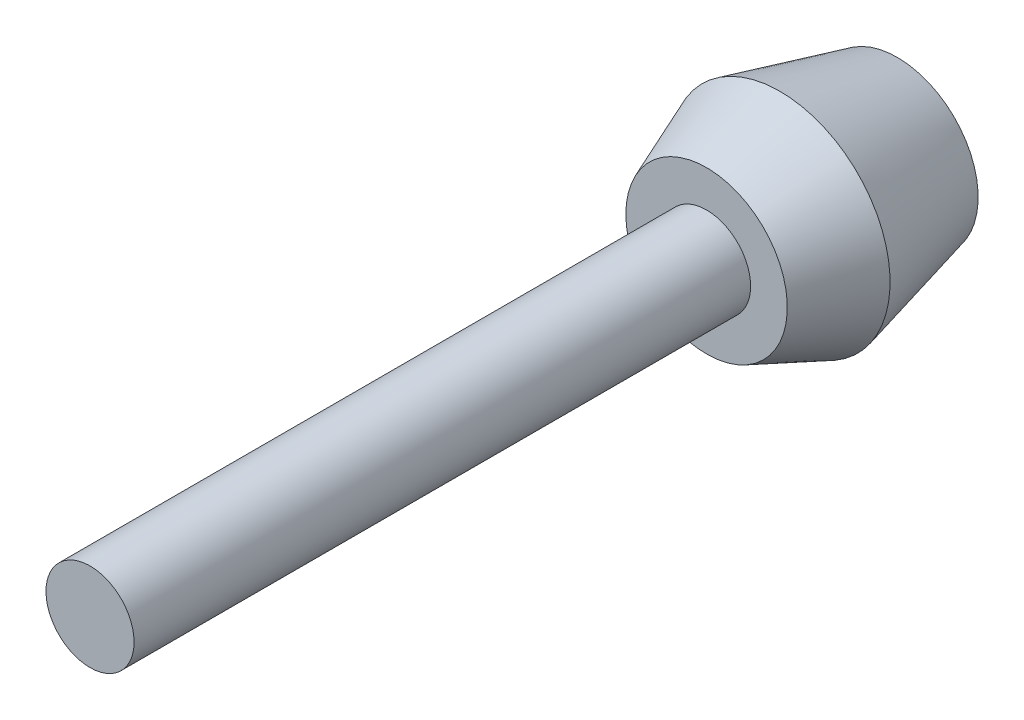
ISO-10303-21;
HEADER;
FILE_DESCRIPTION(('STEP AP214'),'2;1');
FILE_NAME('part.step','',(''),(''),'','','');
FILE_SCHEMA(('AUTOMOTIVE_DESIGN { 1 0 10303 214 1 1 1 1 }'));
ENDSEC;
DATA;
#1=APPLICATION_CONTEXT('core data for automotive mechanical design processes');
#2=APPLICATION_PROTOCOL_DEFINITION('international standard','automotive_design',2000,#1);
#3=PRODUCT_CONTEXT('',#1,'mechanical');
#4=PRODUCT('Part','Part','',(#3));
#5=PRODUCT_RELATED_PRODUCT_CATEGORY('part','',(#4));
#6=PRODUCT_DEFINITION_FORMATION('','',#4);
#7=PRODUCT_DEFINITION_CONTEXT('part definition',#1,'design');
#8=PRODUCT_DEFINITION('design','',#6,#7);
#9=PRODUCT_DEFINITION_SHAPE('','',#8);
#10=(LENGTH_UNIT() NAMED_UNIT(*) SI_UNIT(.MILLI.,.METRE.));
#11=(NAMED_UNIT(*) PLANE_ANGLE_UNIT() SI_UNIT($,.RADIAN.));
#12=(NAMED_UNIT(*) SI_UNIT($,.STERADIAN.) SOLID_ANGLE_UNIT());
#13=UNCERTAINTY_MEASURE_WITH_UNIT(LENGTH_MEASURE(1.E-05),#10,'distance_accuracy_value','');
#14=(GEOMETRIC_REPRESENTATION_CONTEXT(3) GLOBAL_UNCERTAINTY_ASSIGNED_CONTEXT((#13)) GLOBAL_UNIT_ASSIGNED_CONTEXT((#10,
#11,#12)) REPRESENTATION_CONTEXT('',''));
#15=CARTESIAN_POINT('',(0.,0.,0.));
#16=DIRECTION('',(0.,0.,1.));
#17=DIRECTION('',(1.,0.,0.));
#18=AXIS2_PLACEMENT_3D('',#15,#16,#17);
#19=CARTESIAN_POINT('',(0.,0.,0.));
#20=DIRECTION('',(0.,0.,-1.));
#21=DIRECTION('',(0.769107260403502,-0.639119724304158,0.));
#22=AXIS2_PLACEMENT_3D('',#19,#20,#21);
#23=PLANE('',#22);
#24=CARTESIAN_POINT('',(0.,0.,0.));
#25=DIRECTION('',(0.,0.,-1.));
#26=DIRECTION('',(-1.,0.,0.));
#27=AXIS2_PLACEMENT_3D('',#24,#25,#26);
#28=CIRCLE('',#27,5.49999999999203);
#29=CARTESIAN_POINT('',(-5.499999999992,0.,0.));
#30=VERTEX_POINT('',#29);
#31=EDGE_CURVE('E33',#30,#30,#28,.F.);
#32=ORIENTED_EDGE('',*,*,#31,.F.);
#33=EDGE_LOOP('',(#32));
#34=FACE_BOUND('',#33,.T.);
#35=ADVANCED_FACE('F15',(#34),#23,.T.);
#36=CARTESIAN_POINT('',(0.,0.,7.84315022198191));
#37=DIRECTION('',(0.,0.,1.));
#38=DIRECTION('',(-0.769107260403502,0.639119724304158,0.));
#39=AXIS2_PLACEMENT_3D('',#36,#37,#38);
#40=CONICAL_SURFACE('',#39,7.46078755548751,0.244978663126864);
#41=ORIENTED_EDGE('',*,*,#31,.T.);
#42=EDGE_LOOP('',(#41));
#43=FACE_BOUND('',#42,.T.);
#44=CARTESIAN_POINT('',(0.,0.,8.0000000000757));
#45=DIRECTION('',(0.,0.,-1.));
#46=DIRECTION('',(-1.,0.,0.));
#47=AXIS2_PLACEMENT_3D('',#44,#45,#46);
#48=CIRCLE('',#47,7.50000000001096);
#49=CARTESIAN_POINT('',(-7.50000000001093,0.,8.0000000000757));
#50=VERTEX_POINT('',#49);
#51=EDGE_CURVE('E22',#50,#50,#48,.T.);
#52=ORIENTED_EDGE('',*,*,#51,.T.);
#53=EDGE_LOOP('',(#52));
#54=FACE_BOUND('',#53,.T.);
#55=ADVANCED_FACE('F54',(#43,#54),#40,.T.);
#56=CARTESIAN_POINT('',(0.,0.,8.15011337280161));
#57=DIRECTION('',(0.,0.,-1.));
#58=DIRECTION('',(0.769107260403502,-0.639119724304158,0.));
#59=AXIS2_PLACEMENT_3D('',#56,#57,#58);
#60=CONICAL_SURFACE('',#59,7.43995465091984,0.380506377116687);
#61=CARTESIAN_POINT('',(0.,0.,13.));
#62=DIRECTION('',(0.,0.,-1.));
#63=DIRECTION('',(-1.,0.,0.));
#64=AXIS2_PLACEMENT_3D('',#61,#62,#63);
#65=CIRCLE('',#64,5.50000000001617);
#66=CARTESIAN_POINT('',(-5.50000000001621,0.,13.));
#67=VERTEX_POINT('',#66);
#68=EDGE_CURVE('E10',#67,#67,#65,.F.);
#69=ORIENTED_EDGE('',*,*,#68,.F.);
#70=EDGE_LOOP('',(#69));
#71=FACE_BOUND('',#70,.T.);
#72=ORIENTED_EDGE('',*,*,#51,.F.);
#73=EDGE_LOOP('',(#72));
#74=FACE_BOUND('',#73,.T.);
#75=ADVANCED_FACE('F17',(#71,#74),#60,.T.);
#76=CARTESIAN_POINT('',(0.,0.,55.));
#77=DIRECTION('',(0.,0.,1.));
#78=DIRECTION('',(1.,0.,0.));
#79=AXIS2_PLACEMENT_3D('',#76,#77,#78);
#80=PLANE('',#79);
#81=CARTESIAN_POINT('',(0.,0.,55.));
#82=DIRECTION('',(0.,0.,1.));
#83=DIRECTION('',(0.,-1.,0.));
#84=AXIS2_PLACEMENT_3D('',#81,#82,#83);
#85=CIRCLE('',#84,3.);
#86=CARTESIAN_POINT('',(0.,-3.,55.));
#87=VERTEX_POINT('',#86);
#88=EDGE_CURVE('E26',#87,#87,#85,.T.);
#89=ORIENTED_EDGE('',*,*,#88,.T.);
#90=EDGE_LOOP('',(#89));
#91=FACE_BOUND('',#90,.T.);
#92=ADVANCED_FACE('F49',(#91),#80,.T.);
#93=CARTESIAN_POINT('',(0.,0.,2.5));
#94=DIRECTION('',(0.,0.,1.));
#95=DIRECTION('',(-0.692363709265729,0.721548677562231,0.));
#96=AXIS2_PLACEMENT_3D('',#93,#94,#95);
#97=CYLINDRICAL_SURFACE('',#96,3.);
#98=ORIENTED_EDGE('',*,*,#88,.F.);
#99=EDGE_LOOP('',(#98));
#100=FACE_BOUND('',#99,.T.);
#101=CARTESIAN_POINT('',(0.,0.,13.));
#102=DIRECTION('',(0.,0.,1.));
#103=DIRECTION('',(-0.769107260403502,0.639119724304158,0.));
#104=AXIS2_PLACEMENT_3D('',#101,#102,#103);
#105=CIRCLE('',#104,3.);
#106=CARTESIAN_POINT('',(-2.30732178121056,1.91735917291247,13.));
#107=VERTEX_POINT('',#106);
#108=EDGE_CURVE('E30',#107,#107,#105,.T.);
#109=ORIENTED_EDGE('',*,*,#108,.T.);
#110=EDGE_LOOP('',(#109));
#111=FACE_BOUND('',#110,.T.);
#112=ADVANCED_FACE('F39',(#100,#111),#97,.T.);
#113=CARTESIAN_POINT('',(7.82373384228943,9.41496604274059,13.));
#114=DIRECTION('',(0.,0.,-1.));
#115=DIRECTION('',(0.769107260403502,-0.639119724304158,0.));
#116=AXIS2_PLACEMENT_3D('',#113,#114,#115);
#117=PLANE('',#116);
#118=ORIENTED_EDGE('',*,*,#108,.F.);
#119=EDGE_LOOP('',(#118));
#120=FACE_BOUND('',#119,.T.);
#121=ORIENTED_EDGE('',*,*,#68,.T.);
#122=EDGE_LOOP('',(#121));
#123=FACE_BOUND('',#122,.T.);
#124=ADVANCED_FACE('F41',(#120,#123),#117,.F.);
#125=CLOSED_SHELL('',(#35,#55,#75,#92,#112,#124));
#126=MANIFOLD_SOLID_BREP('B1',#125);
#127=ADVANCED_BREP_SHAPE_REPRESENTATION('',(#18,#126),#14);
#128=SHAPE_DEFINITION_REPRESENTATION(#9,#127);
ENDSEC;
END-ISO-10303-21;
